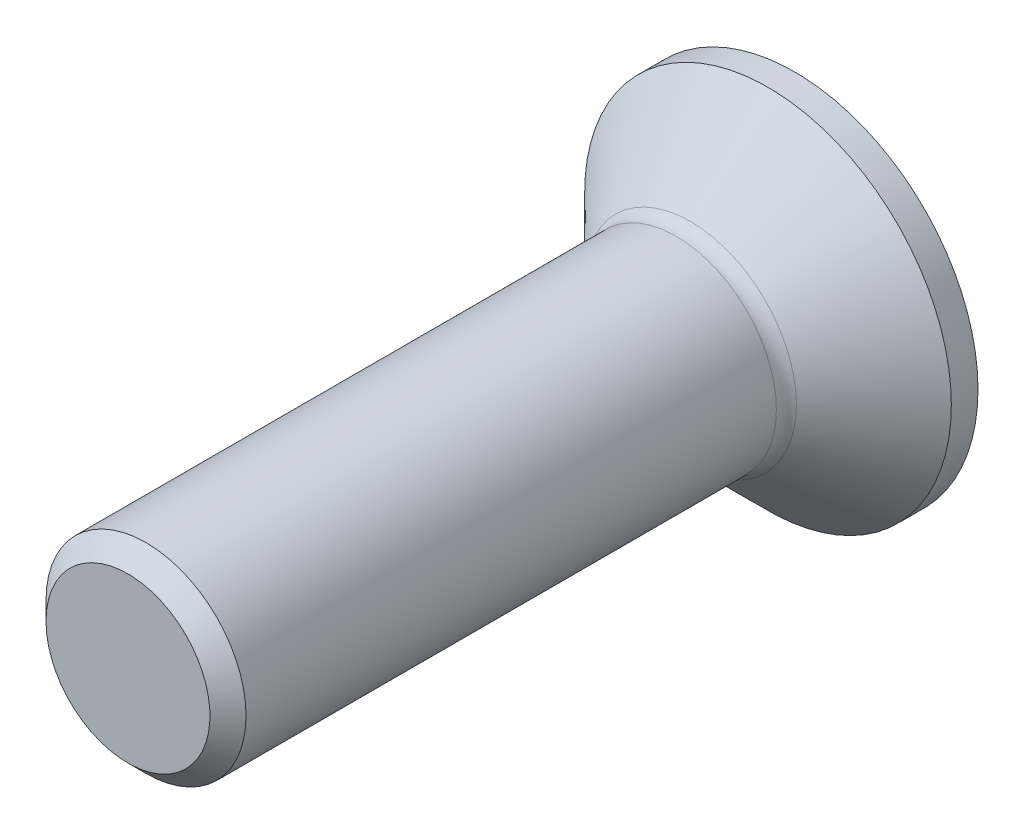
from build123d import *

# Parameters (mm, degrees)
CHAMFER1_SIZE      = 0.270625
FILLET1_R          = 0.3
SKETCH2_OUTSIDE_W  = 10.978
SKETCH2_OUTSIDE_H  = 10.978
SKETCH2_OUTSIDE_R  = 2.75
CUT_EXTRUDE1_DEPTH = 11.947374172
HOLE1_D            = 2
HOLE1_DEPTH        = 1.05
HOLE1_TIP          = 0.577350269
CUT_EXTRUDE2_DEPTH = 1.05


with BuildPart() as part:
    # Sketch1 → Base-Revolve (revolve)
    with BuildSketch(Plane(origin=(0, 0, 0), x_dir=(0, 0, -1), z_dir=(1, 0, 0)), mode=Mode.PRIVATE) as base_revolve_sk:
        Polygon((0, 1.5), (1.65, 3.15), (1.65, 0), (-8.35, 0), (-8.35, 1.5), align=None)
    revolve(base_revolve_sk.sketch.rotate(Axis((0, 0, 8.35), (0, 0, -1)), 90), axis=Axis((0, 0, 8.35), (0, 0, -1)))

    # Chamfer1
    chamfer1_edges = [part.edges().sort_by_distance(p)[0] for p in [
        (-1.5, 0, 8.35),
    ]]
    chamfer(chamfer1_edges, length=CHAMFER1_SIZE)

    # Fillet1
    fillet1_edges = [part.edges().sort_by_distance(p)[0] for p in [
        (-1.5, 0, 0),
    ]]
    fillet(fillet1_edges, radius=FILLET1_R)

    # Sketch2 outside → Cut-Extrude1 (cut, through all)
    with BuildSketch(Plane(origin=(0, 0, -1.65), x_dir=(-1, 0, 0), z_dir=(0, 0, -1))):
        Rectangle(SKETCH2_OUTSIDE_W, SKETCH2_OUTSIDE_H)
        Circle(SKETCH2_OUTSIDE_R, mode=Mode.SUBTRACT)
    extrude(amount=-CUT_EXTRUDE1_DEPTH, mode=Mode.SUBTRACT)

    # Hole1
    with Locations(Plane(origin=(0, 0, -1.65), x_dir=(-1, 0, 0), z_dir=(0, 0, -1))):
        with Locations((0, 0)):
            Hole(HOLE1_D / 2, depth=HOLE1_DEPTH)
            with Locations((0, 0, -(HOLE1_DEPTH + HOLE1_TIP / 2))):  # 120° drill point
                Cone(0, HOLE1_D / 2, HOLE1_TIP, mode=Mode.SUBTRACT)

    # Sketch5 → Cut-Extrude2 (cut)
    with BuildSketch(Plane(origin=(0, 0, -1.65), x_dir=(-1, 0, 0), z_dir=(0, 0, -1))):
        Polygon((-0.577350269, 1), (0.577350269, 1), (1.154700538, 0), (0.577350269, -1), (-0.577350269, -1), (-1.154700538, 0), align=None)
    extrude(amount=-CUT_EXTRUDE2_DEPTH, mode=Mode.SUBTRACT)


solid = part.part
